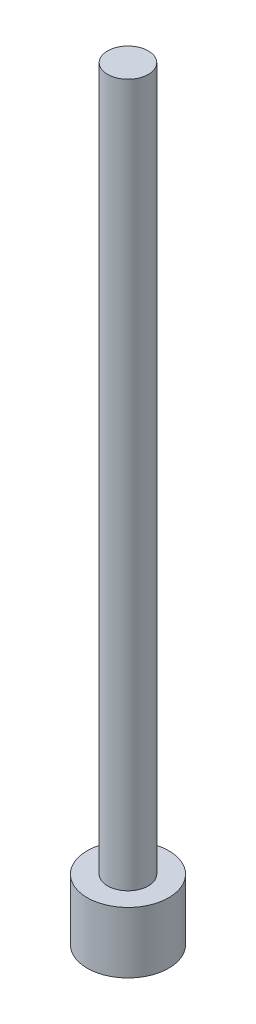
ISO-10303-21;
HEADER;
FILE_DESCRIPTION(('STEP AP214'),'2;1');
FILE_NAME('part.step','',(''),(''),'','','');
FILE_SCHEMA(('AUTOMOTIVE_DESIGN { 1 0 10303 214 1 1 1 1 }'));
ENDSEC;
DATA;
#1=APPLICATION_CONTEXT('core data for automotive mechanical design processes');
#2=APPLICATION_PROTOCOL_DEFINITION('international standard','automotive_design',2000,#1);
#3=PRODUCT_CONTEXT('',#1,'mechanical');
#4=PRODUCT('Part','Part','',(#3));
#5=PRODUCT_RELATED_PRODUCT_CATEGORY('part','',(#4));
#6=PRODUCT_DEFINITION_FORMATION('','',#4);
#7=PRODUCT_DEFINITION_CONTEXT('part definition',#1,'design');
#8=PRODUCT_DEFINITION('design','',#6,#7);
#9=PRODUCT_DEFINITION_SHAPE('','',#8);
#10=(LENGTH_UNIT() NAMED_UNIT(*) SI_UNIT(.MILLI.,.METRE.));
#11=(NAMED_UNIT(*) PLANE_ANGLE_UNIT() SI_UNIT($,.RADIAN.));
#12=(NAMED_UNIT(*) SI_UNIT($,.STERADIAN.) SOLID_ANGLE_UNIT());
#13=UNCERTAINTY_MEASURE_WITH_UNIT(LENGTH_MEASURE(1.E-05),#10,'distance_accuracy_value','');
#14=(GEOMETRIC_REPRESENTATION_CONTEXT(3) GLOBAL_UNCERTAINTY_ASSIGNED_CONTEXT((#13)) GLOBAL_UNIT_ASSIGNED_CONTEXT((#10,
#11,#12)) REPRESENTATION_CONTEXT('',''));
#15=CARTESIAN_POINT('',(0.,0.,0.));
#16=DIRECTION('',(0.,0.,1.));
#17=DIRECTION('',(1.,0.,0.));
#18=AXIS2_PLACEMENT_3D('',#15,#16,#17);
#19=CARTESIAN_POINT('',(0.,3.,0.));
#20=DIRECTION('',(0.,1.,0.));
#21=DIRECTION('',(0.,0.,1.));
#22=AXIS2_PLACEMENT_3D('',#19,#20,#21);
#23=PLANE('',#22);
#24=CARTESIAN_POINT('',(0.,3.,0.));
#25=DIRECTION('',(0.,1.,0.));
#26=DIRECTION('',(0.,0.,1.));
#27=AXIS2_PLACEMENT_3D('',#24,#25,#26);
#28=CIRCLE('',#27,2.);
#29=CARTESIAN_POINT('',(0.,3.,2.));
#30=VERTEX_POINT('',#29);
#31=EDGE_CURVE('E10',#30,#30,#28,.T.);
#32=ORIENTED_EDGE('',*,*,#31,.T.);
#33=EDGE_LOOP('',(#32));
#34=FACE_BOUND('',#33,.T.);
#35=CARTESIAN_POINT('',(0.,3.,0.));
#36=DIRECTION('',(0.,1.,0.));
#37=DIRECTION('',(0.,0.,1.));
#38=AXIS2_PLACEMENT_3D('',#35,#36,#37);
#39=CIRCLE('',#38,1.);
#40=CARTESIAN_POINT('',(0.,3.,1.));
#41=VERTEX_POINT('',#40);
#42=EDGE_CURVE('E45',#41,#41,#39,.T.);
#43=ORIENTED_EDGE('',*,*,#42,.F.);
#44=EDGE_LOOP('',(#43));
#45=FACE_BOUND('',#44,.T.);
#46=ADVANCED_FACE('F30',(#34,#45),#23,.T.);
#47=CARTESIAN_POINT('',(0.,3.,0.));
#48=DIRECTION('',(0.,-1.,0.));
#49=DIRECTION('',(0.,0.,-1.));
#50=AXIS2_PLACEMENT_3D('',#47,#48,#49);
#51=CYLINDRICAL_SURFACE('',#50,2.);
#52=ORIENTED_EDGE('',*,*,#31,.F.);
#53=EDGE_LOOP('',(#52));
#54=FACE_BOUND('',#53,.T.);
#55=CARTESIAN_POINT('',(0.,0.,0.));
#56=DIRECTION('',(0.,1.,0.));
#57=DIRECTION('',(0.,0.,1.));
#58=AXIS2_PLACEMENT_3D('',#55,#56,#57);
#59=CIRCLE('',#58,2.);
#60=CARTESIAN_POINT('',(0.,0.,2.));
#61=VERTEX_POINT('',#60);
#62=EDGE_CURVE('E37',#61,#61,#59,.T.);
#63=ORIENTED_EDGE('',*,*,#62,.T.);
#64=EDGE_LOOP('',(#63));
#65=FACE_BOUND('',#64,.T.);
#66=ADVANCED_FACE('F32',(#54,#65),#51,.T.);
#67=CARTESIAN_POINT('',(0.,0.,0.));
#68=DIRECTION('',(0.,1.,0.));
#69=DIRECTION('',(0.,0.,1.));
#70=AXIS2_PLACEMENT_3D('',#67,#68,#69);
#71=PLANE('',#70);
#72=ORIENTED_EDGE('',*,*,#62,.F.);
#73=EDGE_LOOP('',(#72));
#74=FACE_BOUND('',#73,.T.);
#75=ADVANCED_FACE('F57',(#74),#71,.F.);
#76=CARTESIAN_POINT('',(0.,37.5,0.));
#77=DIRECTION('',(0.,-1.,0.));
#78=DIRECTION('',(0.,0.,-1.));
#79=AXIS2_PLACEMENT_3D('',#76,#77,#78);
#80=CYLINDRICAL_SURFACE('',#79,1.);
#81=CARTESIAN_POINT('',(0.,37.5,0.));
#82=DIRECTION('',(0.,1.,0.));
#83=DIRECTION('',(0.,0.,1.));
#84=AXIS2_PLACEMENT_3D('',#81,#82,#83);
#85=CIRCLE('',#84,1.);
#86=CARTESIAN_POINT('',(0.,37.5,1.));
#87=VERTEX_POINT('',#86);
#88=EDGE_CURVE('E41',#87,#87,#85,.T.);
#89=ORIENTED_EDGE('',*,*,#88,.F.);
#90=EDGE_LOOP('',(#89));
#91=FACE_BOUND('',#90,.T.);
#92=ORIENTED_EDGE('',*,*,#42,.T.);
#93=EDGE_LOOP('',(#92));
#94=FACE_BOUND('',#93,.T.);
#95=ADVANCED_FACE('F51',(#91,#94),#80,.T.);
#96=CARTESIAN_POINT('',(0.,37.5,0.));
#97=DIRECTION('',(0.,1.,0.));
#98=DIRECTION('',(0.,0.,1.));
#99=AXIS2_PLACEMENT_3D('',#96,#97,#98);
#100=PLANE('',#99);
#101=ORIENTED_EDGE('',*,*,#88,.T.);
#102=EDGE_LOOP('',(#101));
#103=FACE_BOUND('',#102,.T.);
#104=ADVANCED_FACE('F65',(#103),#100,.T.);
#105=CLOSED_SHELL('',(#46,#66,#75,#95,#104));
#106=MANIFOLD_SOLID_BREP('B2',#105);
#107=ADVANCED_BREP_SHAPE_REPRESENTATION('',(#18,#106),#14);
#108=SHAPE_DEFINITION_REPRESENTATION(#9,#107);
ENDSEC;
END-ISO-10303-21;
